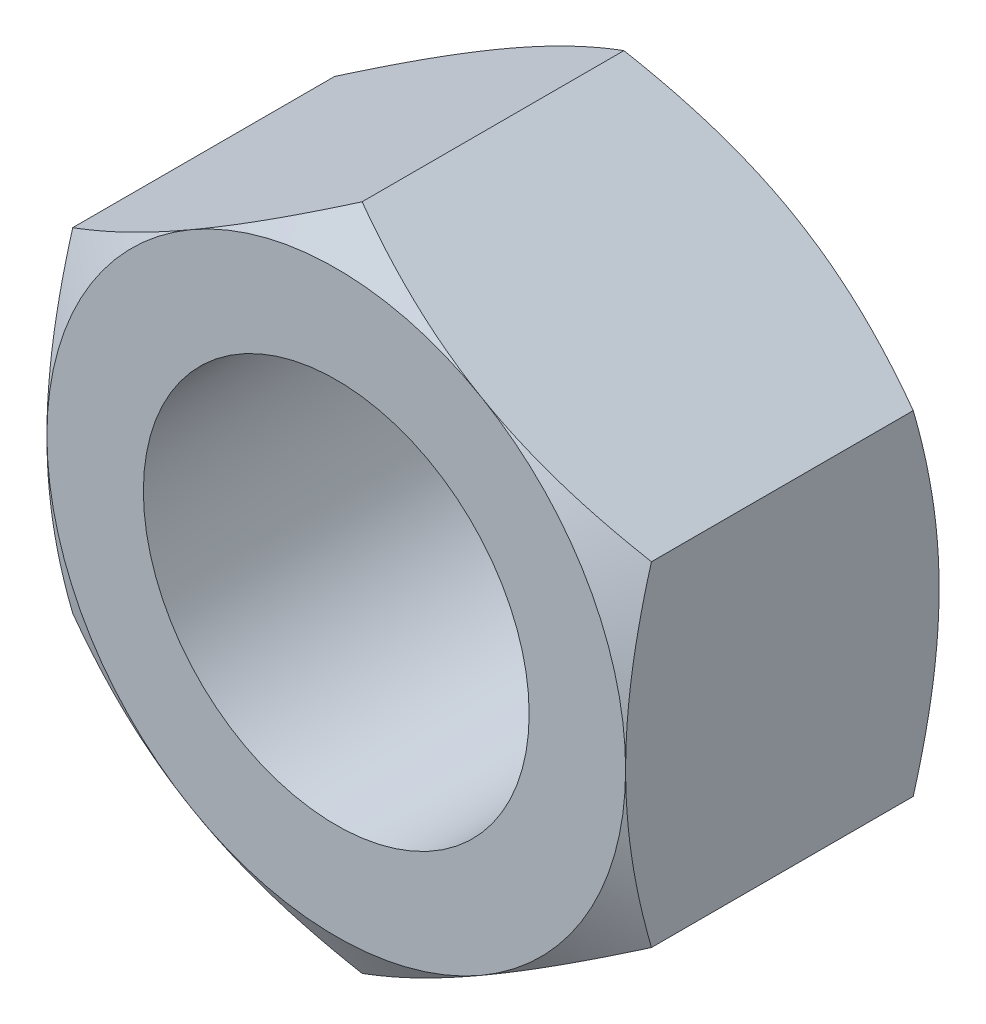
from build123d import *

# Parameters (mm, degrees)
BASE_EXTRUSION_DEPTH    = 13
ESQUISSE3_R             = 8
ENL_V_MAT_EXTRU_1_DEPTH = 23.472205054


with BuildPart() as part:
    # Esquisse1 → Base-Extrusion (new body)
    with BuildSketch(Plane.XY):
        Polygon((12, -6.92820323), (12, 6.92820323), (0, 13.856406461), (-12, 6.92820323), (-12, -6.92820323), (0, -13.856406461), align=None)
    extrude(amount=-BASE_EXTRUSION_DEPTH)

    # Esquisse2 → Enl_vement de mati_re-R_volution1 (revolve, cut)
    with BuildSketch(Plane(origin=(0, 0, 0), x_dir=(1, 0, 0), z_dir=(0, 1, 0)), mode=Mode.PRIVATE) as enl_vement_de_mati_re_r_volution1_sk:
        Polygon((-12, 0), (-24.258330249, 0), (-24.258330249, 13), (-12, 13), (-23.258330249, 6.5), align=None)
    revolve(enl_vement_de_mati_re_r_volution1_sk.sketch.rotate(Axis((0, 0, -13), (0, 0, 1)), 180), axis=Axis((0, 0, -13), (0, 0, 1)), mode=Mode.SUBTRACT)

    # Esquisse3 → Enl_v. mat.-Extru.1 (cut, through all)
    with BuildSketch(Plane.XY):
        Circle(ESQUISSE3_R)
    extrude(amount=-ENL_V_MAT_EXTRU_1_DEPTH, mode=Mode.SUBTRACT)


solid = part.part
